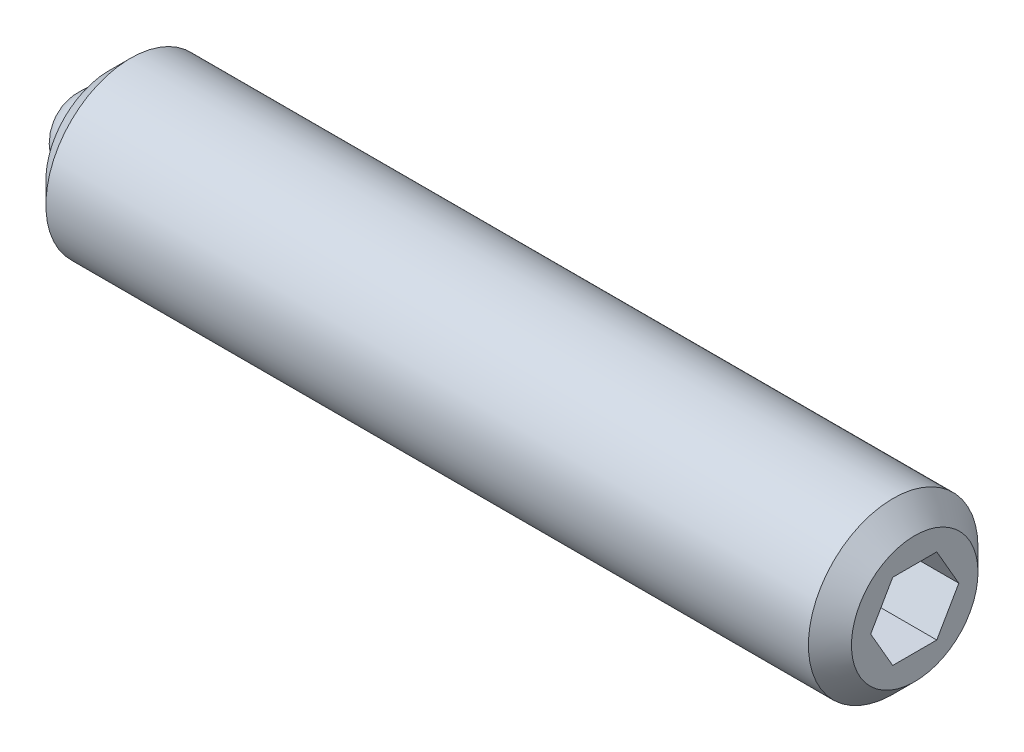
from build123d import *

# Parameters (mm, degrees)
SKETCH2_R           = 1
BOSS_EXTRUDE1_DEPTH = 9.5
CHAMFER1_SIZE       = 0.254
CHAMFER2_SIZE       = 0.254
CUT_EXTRUDE2_DEPTH  = 2
SKETCH3_R           = 0.5
CUT_EXTRUDE3_DEPTH  = 0.5


with BuildPart() as part:
    # Sketch2 → Boss-Extrude1 (new body)
    with BuildSketch(Plane(origin=(0, 0, 0), x_dir=(0, 0, -1), z_dir=(1, 0, 0))):
        Circle(SKETCH2_R)
    extrude(amount=BOSS_EXTRUDE1_DEPTH)

    # Chamfer1
    chamfer1_edges = [part.edges().sort_by_distance(p)[0] for p in [
        (0, 0, 1),
    ]]
    chamfer(chamfer1_edges, length=CHAMFER1_SIZE)

    # Chamfer2
    chamfer2_edges = [part.edges().sort_by_distance(p)[0] for p in [
        (9.5, 0, 1),
    ]]
    chamfer(chamfer2_edges, length=CHAMFER2_SIZE)

    # Sketch4 → Cut-Extrude2 (cut)
    with BuildSketch(Plane(origin=(9.5, 0, 0), x_dir=(0, 0, -1), z_dir=(1, 0, 0))):
        Polygon((0.519615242, 0), (0.259807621, 0.45), (-0.259807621, 0.45), (-0.519615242, 0), (-0.259807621, -0.45), (0.259807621, -0.45), align=None)
    extrude(amount=-CUT_EXTRUDE2_DEPTH, mode=Mode.SUBTRACT)

    # Sketch3 → Cut-Extrude3 (cut)
    with BuildSketch(Plane.ZY):
        Circle(SKETCH3_R)
    extrude(amount=-CUT_EXTRUDE3_DEPTH, mode=Mode.SUBTRACT)


with BuildPart() as body_2:
    # Sketch5 → Revolve1 (revolve)
    with BuildSketch(Plane.ZY):
        with BuildLine():
            Line((0, 0), (0, -0.5))
            ThreePointArc((0, -0.5), (-0.5, 0), (0, 0.5))
            Line((0, 0.5), (0, 0))
        make_face()
    revolve(axis=Axis((0, 0, 0), (0, 1, 0)))


solid = Compound([part.part, body_2.part])
